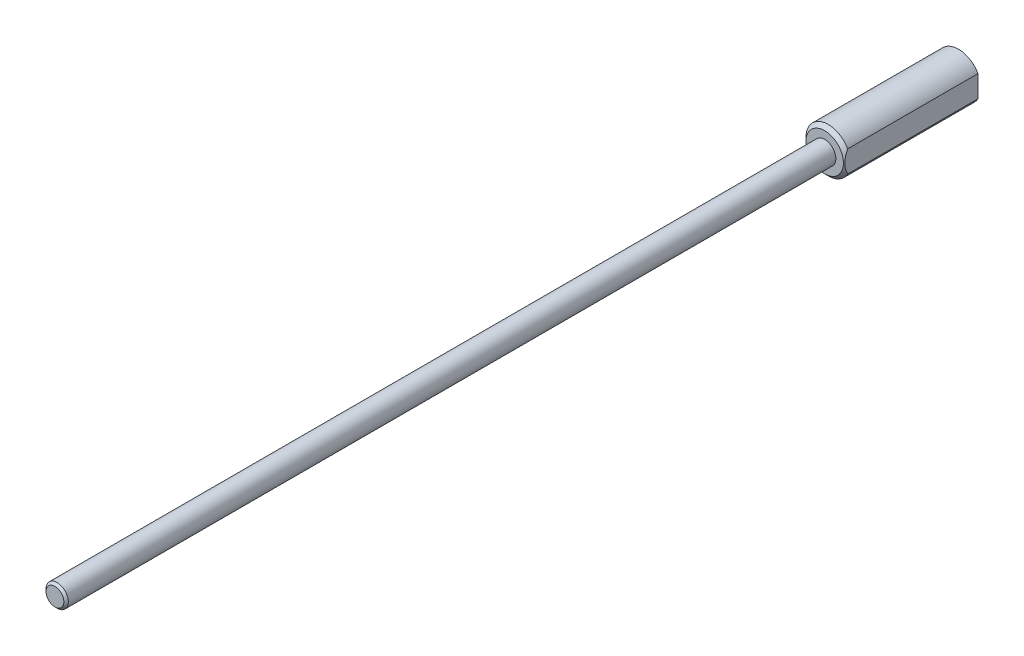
from build123d import *

# Parameters (mm, degrees)
SKETCH2_R               = 6.35
SKETCH2_R_2             = 3.175
BOSS_EXTRUDE1_DEPTH     = 38.1
CHAMFER1_SIZE           = 1.016
CUT_EXTRUDE1_DEPTH      = 40.144028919
CUT_EXTRUDE1_DEPTH_BACK = 40.144028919
BOSS_EXTRUDE2_START     = 19.05
SKETCH4_R               = 3.175
BOSS_EXTRUDE2_DEPTH     = 238.125
CHAMFER2_SIZE           = 0.635


with BuildPart() as part:
    # Sketch2 → Boss-Extrude1 (new body)
    with BuildSketch(Plane.XY):
        with Locations(Location((0, 0, 0), (0, 0, 180))):
            Circle(SKETCH2_R)
        with Locations(Location((0, 0, 0), (0, 0, 180))):
            Circle(SKETCH2_R_2, mode=Mode.SUBTRACT)
    extrude(amount=BOSS_EXTRUDE1_DEPTH)

    # Chamfer1
    chamfer1_edges = [part.edges().sort_by_distance(p)[0] for p in [
        (6.35, 0, 38.1),
    ]]
    chamfer(chamfer1_edges, length=CHAMFER1_SIZE)

    # Sketch3 → Cut-Extrude1 (cut, two sides: drawn at the far end of the back side and taken through both)
    with BuildSketch(Plane.XY.offset(-CUT_EXTRUDE1_DEPTH_BACK)):
        Polygon((5.5372, 43.490339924), (5.5372, 3.108362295), (5.5372, -3.108362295), (5.5372, -43.490339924), (86.301155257, -43.490339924), (86.301155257, 43.490339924), align=None)
    extrude(amount=CUT_EXTRUDE1_DEPTH + CUT_EXTRUDE1_DEPTH_BACK, mode=Mode.SUBTRACT)


with BuildPart() as body_2:
    # Sketch4 → Boss-Extrude2 (new body)
    with BuildSketch(Plane.XY.offset(BOSS_EXTRUDE2_START)):
        Circle(SKETCH4_R)
    extrude(amount=BOSS_EXTRUDE2_DEPTH)

    # Chamfer2
    chamfer2_edges = [body_2.edges().sort_by_distance(p)[0] for p in [
        (-3.175, 0, 257.175),
    ]]
    chamfer(chamfer2_edges, length=CHAMFER2_SIZE)


solid = Compound([part.part, body_2.part])
